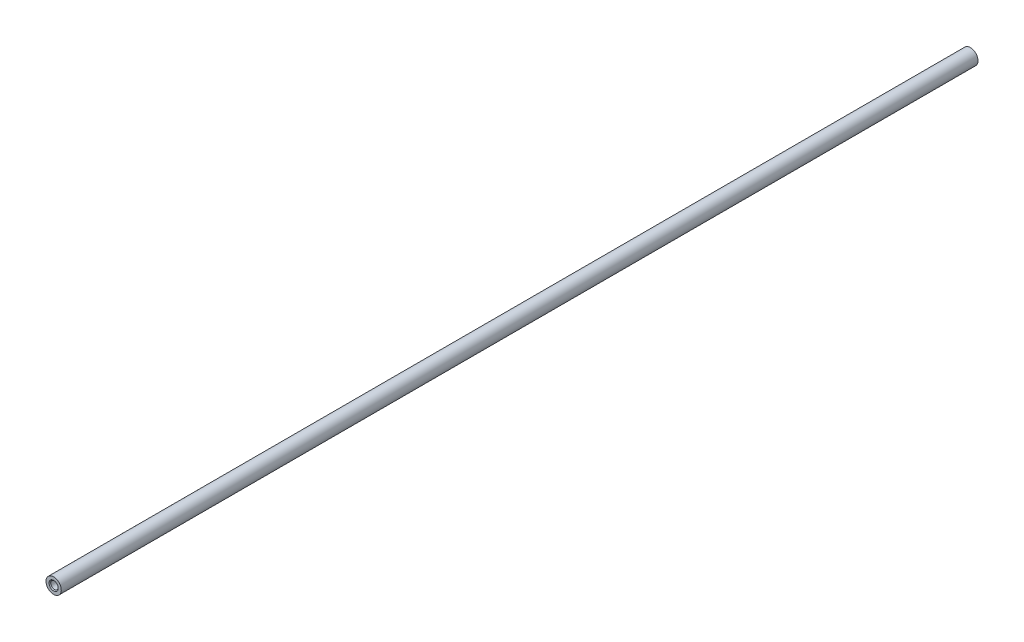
ISO-10303-21;
HEADER;
FILE_DESCRIPTION(('STEP AP214'),'2;1');
FILE_NAME('part.step','',(''),(''),'','','');
FILE_SCHEMA(('AUTOMOTIVE_DESIGN { 1 0 10303 214 1 1 1 1 }'));
ENDSEC;
DATA;
#1=APPLICATION_CONTEXT('core data for automotive mechanical design processes');
#2=APPLICATION_PROTOCOL_DEFINITION('international standard','automotive_design',2000,#1);
#3=PRODUCT_CONTEXT('',#1,'mechanical');
#4=PRODUCT('Part','Part','',(#3));
#5=PRODUCT_RELATED_PRODUCT_CATEGORY('part','',(#4));
#6=PRODUCT_DEFINITION_FORMATION('','',#4);
#7=PRODUCT_DEFINITION_CONTEXT('part definition',#1,'design');
#8=PRODUCT_DEFINITION('design','',#6,#7);
#9=PRODUCT_DEFINITION_SHAPE('','',#8);
#10=(LENGTH_UNIT() NAMED_UNIT(*) SI_UNIT(.MILLI.,.METRE.));
#11=(NAMED_UNIT(*) PLANE_ANGLE_UNIT() SI_UNIT($,.RADIAN.));
#12=(NAMED_UNIT(*) SI_UNIT($,.STERADIAN.) SOLID_ANGLE_UNIT());
#13=UNCERTAINTY_MEASURE_WITH_UNIT(LENGTH_MEASURE(1.E-05),#10,'distance_accuracy_value','');
#14=(GEOMETRIC_REPRESENTATION_CONTEXT(3) GLOBAL_UNCERTAINTY_ASSIGNED_CONTEXT((#13)) GLOBAL_UNIT_ASSIGNED_CONTEXT((#10,
#11,#12)) REPRESENTATION_CONTEXT('',''));
#15=CARTESIAN_POINT('',(0.,0.,0.));
#16=DIRECTION('',(0.,0.,1.));
#17=DIRECTION('',(1.,0.,0.));
#18=AXIS2_PLACEMENT_3D('',#15,#16,#17);
#19=CARTESIAN_POINT('',(0.,0.,-5.99999999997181));
#20=DIRECTION('',(0.,0.,1.));
#21=DIRECTION('',(1.,0.,0.));
#22=AXIS2_PLACEMENT_3D('',#19,#20,#21);
#23=CONICAL_SURFACE('',#22,1.2295000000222,1.04719755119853);
#24=CARTESIAN_POINT('',(0.,0.,-6.7098521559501));
#25=VERTEX_POINT('',#24);
#26=VERTEX_LOOP('',#25);
#27=FACE_BOUND('',#26,.T.);
#28=CARTESIAN_POINT('',(0.,0.,-6.));
#29=DIRECTION('',(0.,0.,1.));
#30=DIRECTION('',(0.,-1.,0.));
#31=AXIS2_PLACEMENT_3D('',#28,#29,#30);
#32=CIRCLE('',#31,1.2295);
#33=CARTESIAN_POINT('',(0.,-1.2295,-6.));
#34=VERTEX_POINT('',#33);
#35=EDGE_CURVE('E31',#34,#34,#32,.T.);
#36=ORIENTED_EDGE('',*,*,#35,.T.);
#37=EDGE_LOOP('',(#36));
#38=FACE_BOUND('',#37,.T.);
#39=ADVANCED_FACE('F16',(#27,#38),#23,.F.);
#40=CARTESIAN_POINT('',(0.,0.,-6.70985215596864));
#41=DIRECTION('',(0.,0.,1.));
#42=DIRECTION('',(0.,-1.,0.));
#43=AXIS2_PLACEMENT_3D('',#40,#41,#42);
#44=CYLINDRICAL_SURFACE('',#43,1.2295);
#45=CARTESIAN_POINT('',(0.,0.,-0.270499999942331));
#46=DIRECTION('',(0.,0.,1.));
#47=DIRECTION('',(0.,-1.,0.));
#48=AXIS2_PLACEMENT_3D('',#45,#46,#47);
#49=CIRCLE('',#48,1.2295000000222);
#50=CARTESIAN_POINT('',(0.,-1.2295000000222,-0.270499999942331));
#51=VERTEX_POINT('',#50);
#52=EDGE_CURVE('E22',#51,#51,#49,.T.);
#53=ORIENTED_EDGE('',*,*,#52,.T.);
#54=EDGE_LOOP('',(#53));
#55=FACE_BOUND('',#54,.T.);
#56=ORIENTED_EDGE('',*,*,#35,.F.);
#57=EDGE_LOOP('',(#56));
#58=FACE_BOUND('',#57,.T.);
#59=ADVANCED_FACE('F27',(#55,#58),#44,.F.);
#60=CARTESIAN_POINT('',(0.,0.,-1.13686788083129E-10));
#61=DIRECTION('',(0.,0.,1.));
#62=DIRECTION('',(0.,-1.,0.));
#63=AXIS2_PLACEMENT_3D('',#60,#61,#62);
#64=CONICAL_SURFACE('',#63,1.49999999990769,0.785398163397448);
#65=CARTESIAN_POINT('',(0.,0.,-5.68433692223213E-11));
#66=DIRECTION('',(0.,0.,1.));
#67=DIRECTION('',(0.,-1.,0.));
#68=AXIS2_PLACEMENT_3D('',#65,#66,#67);
#69=CIRCLE('',#68,1.49999999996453);
#70=CARTESIAN_POINT('',(0.,-1.49999999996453,-5.68434188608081E-11));
#71=VERTEX_POINT('',#70);
#72=EDGE_CURVE('E11',#71,#71,#69,.T.);
#73=ORIENTED_EDGE('',*,*,#72,.T.);
#74=EDGE_LOOP('',(#73));
#75=FACE_BOUND('',#74,.T.);
#76=ORIENTED_EDGE('',*,*,#52,.F.);
#77=EDGE_LOOP('',(#76));
#78=FACE_BOUND('',#77,.T.);
#79=ADVANCED_FACE('F61',(#75,#78),#64,.F.);
#80=CARTESIAN_POINT('',(0.,0.,0.));
#81=DIRECTION('',(0.,0.,-1.));
#82=DIRECTION('',(-1.,0.,0.));
#83=AXIS2_PLACEMENT_3D('',#80,#81,#82);
#84=PLANE('',#83);
#85=ORIENTED_EDGE('',*,*,#72,.F.);
#86=EDGE_LOOP('',(#85));
#87=FACE_BOUND('',#86,.T.);
#88=CARTESIAN_POINT('',(0.,0.,0.));
#89=DIRECTION('',(0.,0.,1.));
#90=DIRECTION('',(1.,0.,0.));
#91=AXIS2_PLACEMENT_3D('',#88,#89,#90);
#92=CIRCLE('',#91,2.5);
#93=CARTESIAN_POINT('',(2.5,0.,0.));
#94=VERTEX_POINT('',#93);
#95=EDGE_CURVE('E38',#94,#94,#92,.T.);
#96=ORIENTED_EDGE('',*,*,#95,.T.);
#97=EDGE_LOOP('',(#96));
#98=FACE_BOUND('',#97,.T.);
#99=ADVANCED_FACE('F47',(#87,#98),#84,.F.);
#100=CARTESIAN_POINT('',(0.,0.,-223.));
#101=DIRECTION('',(0.,0.,1.));
#102=DIRECTION('',(1.,0.,0.));
#103=AXIS2_PLACEMENT_3D('',#100,#101,#102);
#104=CYLINDRICAL_SURFACE('',#103,2.5);
#105=CARTESIAN_POINT('',(0.,0.,-300.));
#106=DIRECTION('',(0.,0.,1.));
#107=DIRECTION('',(1.,0.,0.));
#108=AXIS2_PLACEMENT_3D('',#105,#106,#107);
#109=CIRCLE('',#108,2.5);
#110=CARTESIAN_POINT('',(2.5,0.,-300.));
#111=VERTEX_POINT('',#110);
#112=EDGE_CURVE('E33',#111,#111,#109,.T.);
#113=ORIENTED_EDGE('',*,*,#112,.T.);
#114=EDGE_LOOP('',(#113));
#115=FACE_BOUND('',#114,.T.);
#116=ORIENTED_EDGE('',*,*,#95,.F.);
#117=EDGE_LOOP('',(#116));
#118=FACE_BOUND('',#117,.T.);
#119=ADVANCED_FACE('F28',(#115,#118),#104,.T.);
#120=CARTESIAN_POINT('',(0.,0.,-300.));
#121=DIRECTION('',(0.,0.,1.));
#122=DIRECTION('',(1.,0.,0.));
#123=AXIS2_PLACEMENT_3D('',#120,#121,#122);
#124=PLANE('',#123);
#125=ORIENTED_EDGE('',*,*,#112,.F.);
#126=EDGE_LOOP('',(#125));
#127=FACE_BOUND('',#126,.T.);
#128=ADVANCED_FACE('F50',(#127),#124,.F.);
#129=CLOSED_SHELL('',(#39,#59,#79,#99,#119,#128));
#130=MANIFOLD_SOLID_BREP('B1',#129);
#131=ADVANCED_BREP_SHAPE_REPRESENTATION('',(#18,#130),#14);
#132=SHAPE_DEFINITION_REPRESENTATION(#9,#131);
ENDSEC;
END-ISO-10303-21;
